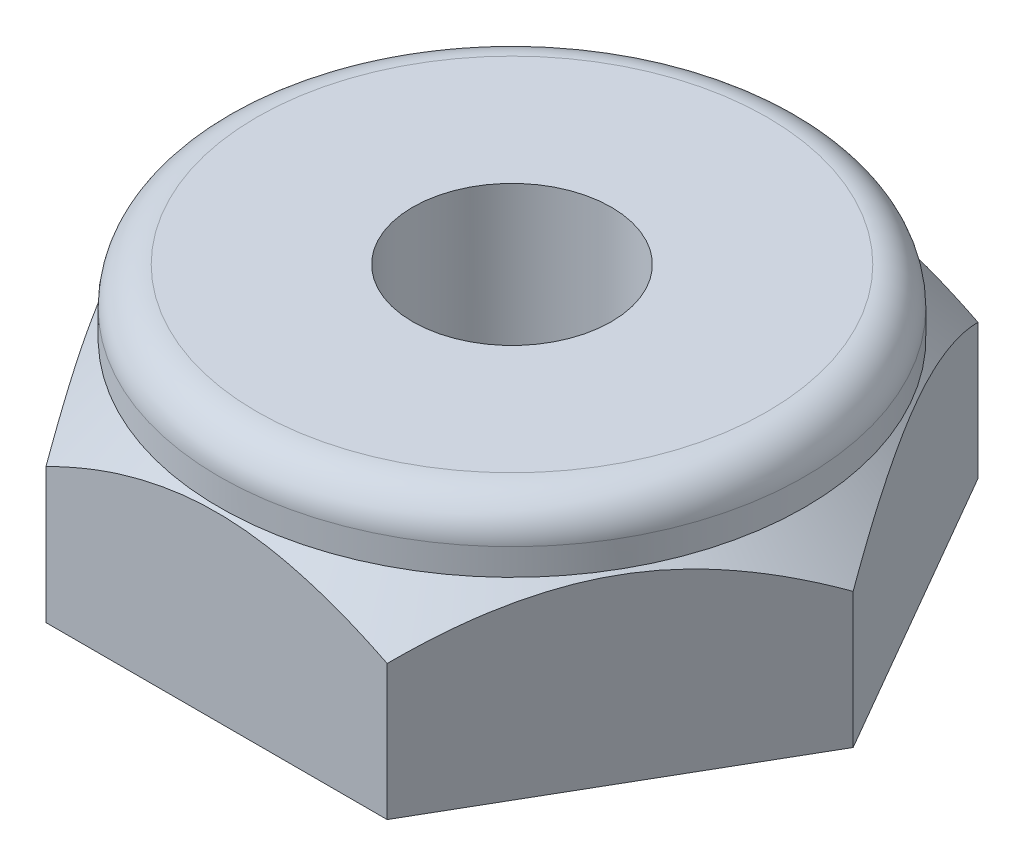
ISO-10303-21;
HEADER;
FILE_DESCRIPTION(('STEP AP214'),'2;1');
FILE_NAME('part.step','',(''),(''),'','','');
FILE_SCHEMA(('AUTOMOTIVE_DESIGN { 1 0 10303 214 1 1 1 1 }'));
ENDSEC;
DATA;
#1=APPLICATION_CONTEXT('core data for automotive mechanical design processes');
#2=APPLICATION_PROTOCOL_DEFINITION('international standard','automotive_design',2000,#1);
#3=PRODUCT_CONTEXT('',#1,'mechanical');
#4=PRODUCT('Part','Part','',(#3));
#5=PRODUCT_RELATED_PRODUCT_CATEGORY('part','',(#4));
#6=PRODUCT_DEFINITION_FORMATION('','',#4);
#7=PRODUCT_DEFINITION_CONTEXT('part definition',#1,'design');
#8=PRODUCT_DEFINITION('design','',#6,#7);
#9=PRODUCT_DEFINITION_SHAPE('','',#8);
#10=(LENGTH_UNIT() NAMED_UNIT(*) SI_UNIT(.MILLI.,.METRE.));
#11=(NAMED_UNIT(*) PLANE_ANGLE_UNIT() SI_UNIT($,.RADIAN.));
#12=(NAMED_UNIT(*) SI_UNIT($,.STERADIAN.) SOLID_ANGLE_UNIT());
#13=UNCERTAINTY_MEASURE_WITH_UNIT(LENGTH_MEASURE(1.E-05),#10,'distance_accuracy_value','');
#14=(GEOMETRIC_REPRESENTATION_CONTEXT(3) GLOBAL_UNCERTAINTY_ASSIGNED_CONTEXT((#13)) GLOBAL_UNIT_ASSIGNED_CONTEXT((#10,
#11,#12)) REPRESENTATION_CONTEXT('',''));
#15=CARTESIAN_POINT('',(0.,0.,0.));
#16=DIRECTION('',(0.,0.,1.));
#17=DIRECTION('',(1.,0.,0.));
#18=AXIS2_PLACEMENT_3D('',#15,#16,#17);
#19=CARTESIAN_POINT('',(-4.54605601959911,-3.302,0.));
#20=DIRECTION('',(-0.866025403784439,0.,0.5));
#21=DIRECTION('',(0.,1.,0.));
#22=AXIS2_PLACEMENT_3D('',#19,#20,#21);
#23=PLANE('',#22);
#24=CARTESIAN_POINT('',(-4.54605601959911,-1.5,0.));
#25=CARTESIAN_POINT('',(-4.49883210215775,-1.45279197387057,0.0817909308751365));
#26=CARTESIAN_POINT('',(-4.4511263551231,-1.40727797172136,0.164324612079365));
#27=CARTESIAN_POINT('',(-4.35662609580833,-1.32209943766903,0.327794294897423));
#28=CARTESIAN_POINT('',(-4.30986746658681,-1.28227694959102,0.408669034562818));
#29=CARTESIAN_POINT('',(-4.21708676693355,-1.20845985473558,0.569265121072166));
#30=CARTESIAN_POINT('',(-4.17109342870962,-1.17431349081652,0.64893268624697));
#31=CARTESIAN_POINT('',(-4.07960762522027,-1.11184717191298,0.807566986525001));
#32=CARTESIAN_POINT('',(-4.03413620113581,-1.08339275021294,0.886492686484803));
#33=CARTESIAN_POINT('',(-3.94336403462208,-1.03228388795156,1.04412591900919));
#34=CARTESIAN_POINT('',(-3.89807712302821,-1.00952755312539,1.12280792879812));
#35=CARTESIAN_POINT('',(-3.83737391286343,-0.982959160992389,1.22816793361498));
#36=CARTESIAN_POINT('',(-3.82225223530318,-0.976661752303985,1.25440530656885));
#37=CARTESIAN_POINT('',(-3.77413176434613,-0.957650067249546,1.33782250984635));
#38=CARTESIAN_POINT('',(-3.74097847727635,-0.946077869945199,1.39518141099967));
#39=CARTESIAN_POINT('',(-3.68311575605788,-0.928697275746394,1.49521841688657));
#40=CARTESIAN_POINT('',(-3.65846760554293,-0.922173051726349,1.53780933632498));
#41=CARTESIAN_POINT('',(-3.60930491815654,-0.910979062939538,1.62277521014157));
#42=CARTESIAN_POINT('',(-3.58479128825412,-0.906292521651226,1.66514845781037));
#43=CARTESIAN_POINT('',(-3.53584321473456,-0.898765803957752,1.74979870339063));
#44=CARTESIAN_POINT('',(-3.51140905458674,-0.895915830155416,1.79207499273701));
#45=CARTESIAN_POINT('',(-3.46255878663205,-0.892060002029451,1.87665195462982));
#46=CARTESIAN_POINT('',(-3.43814269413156,-0.8910518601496,1.9189525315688));
#47=CARTESIAN_POINT('',(-3.38951157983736,-0.890854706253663,2.00320328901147));
#48=CARTESIAN_POINT('',(-3.36529657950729,-0.891650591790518,2.04515344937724));
#49=CARTESIAN_POINT('',(-3.31696230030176,-0.895028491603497,2.12890522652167));
#50=CARTESIAN_POINT('',(-3.29284293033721,-0.897606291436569,2.1707069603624));
#51=CARTESIAN_POINT('',(-3.24465286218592,-0.904545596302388,2.25428475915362));
#52=CARTESIAN_POINT('',(-3.22058231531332,-0.908910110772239,2.29606066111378));
#53=CARTESIAN_POINT('',(-3.17242754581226,-0.919414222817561,2.37969995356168));
#54=CARTESIAN_POINT('',(-3.14834402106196,-0.925563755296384,2.42156249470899));
#55=CARTESIAN_POINT('',(-3.10009377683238,-0.939631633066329,2.50548193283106));
#56=CARTESIAN_POINT('',(-3.07592844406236,-0.947566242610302,2.54753689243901));
#57=CARTESIAN_POINT('',(-3.02743568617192,-0.965197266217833,2.6319398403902));
#58=CARTESIAN_POINT('',(-3.00311029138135,-0.974915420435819,2.67428443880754));
#59=CARTESIAN_POINT('',(-2.95421526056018,-0.996111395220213,2.75935900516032));
#60=CARTESIAN_POINT('',(-2.92964817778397,-1.00761550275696,2.80208387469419));
#61=CARTESIAN_POINT('',(-2.88016701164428,-1.03236763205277,2.88799699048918));
#62=CARTESIAN_POINT('',(-2.85525544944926,-1.04564517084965,2.9311781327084));
#63=CARTESIAN_POINT('',(-2.78424535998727,-1.08571538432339,3.0540705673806));
#64=CARTESIAN_POINT('',(-2.73832755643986,-1.11432093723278,3.13330122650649));
#65=CARTESIAN_POINT('',(-2.64624407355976,-1.17689706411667,3.29216490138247));
#66=CARTESIAN_POINT('',(-2.60009667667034,-1.21097523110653,3.37176579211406));
#67=CARTESIAN_POINT('',(-2.50734219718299,-1.28444565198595,3.53184169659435));
#68=CARTESIAN_POINT('',(-2.46076161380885,-1.32396486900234,3.61227339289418));
#69=CARTESIAN_POINT('',(-2.36694163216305,-1.4083199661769,3.77442193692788));
#70=CARTESIAN_POINT('',(-2.31973518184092,-1.45329247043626,3.85608699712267));
#71=CARTESIAN_POINT('',(-2.27302800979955,-1.5,3.937));
#72=B_SPLINE_CURVE_WITH_KNOTS('',3,(#24,#25,#26,#27,#28,#29,#30,#31,#32,#33,#34,#35,#36,#37,#38,
#39,#40,#41,#42,#43,#44,#45,#46,#47,#48,#49,#50,#51,#52,#53,#54,#55,#56,#57,#58,#59,#60,#61,#62,
#63,#64,#65,#66,#67,#68,#69,#70,#71),.UNSPECIFIED.,.F.,.F.,(4,2,2,2,2,2,2,2,2,2,2,2,2,2,2,2,2,2,
2,2,2,2,2,4),(0.,0.316790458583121,0.62135542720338,0.915599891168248,1.20174788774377,
1.48233951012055,1.57512947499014,1.7768095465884,1.92569920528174,2.073196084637,
2.21989946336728,2.36642051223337,2.51171949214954,2.65667599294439,2.80187766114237,
2.94790350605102,3.09531796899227,3.24466566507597,3.39646704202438,3.55121509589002,
3.83888140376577,4.13311648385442,4.43601850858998,4.74939840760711),.UNSPECIFIED.);
#73=CARTESIAN_POINT('',(-4.54605601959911,-1.5,0.));
#74=VERTEX_POINT('',#73);
#75=CARTESIAN_POINT('',(-2.27302800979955,-1.5,3.937));
#76=VERTEX_POINT('',#75);
#77=EDGE_CURVE('E118',#74,#76,#72,.T.);
#78=ORIENTED_EDGE('',*,*,#77,.F.);
#79=DIRECTION('',(0.,1.,0.));
#80=VECTOR('',#79,1.);
#81=CARTESIAN_POINT('',(-4.54605601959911,-3.302,0.));
#82=LINE('',#81,#80);
#83=CARTESIAN_POINT('',(-4.54605601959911,-3.302,0.));
#84=VERTEX_POINT('',#83);
#85=EDGE_CURVE('E113',#84,#74,#82,.T.);
#86=ORIENTED_EDGE('',*,*,#85,.F.);
#87=DIRECTION('',(0.5,0.,0.866025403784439));
#88=VECTOR('',#87,1.);
#89=CARTESIAN_POINT('',(-4.54605601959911,-3.302,0.));
#90=LINE('',#89,#88);
#91=CARTESIAN_POINT('',(-2.27302800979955,-3.302,3.937));
#92=VERTEX_POINT('',#91);
#93=EDGE_CURVE('E116',#84,#92,#90,.T.);
#94=ORIENTED_EDGE('',*,*,#93,.T.);
#95=DIRECTION('',(0.,1.,0.));
#96=VECTOR('',#95,1.);
#97=CARTESIAN_POINT('',(-2.27302800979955,-3.302,3.937));
#98=LINE('',#97,#96);
#99=EDGE_CURVE('E11',#92,#76,#98,.T.);
#100=ORIENTED_EDGE('',*,*,#99,.T.);
#101=EDGE_LOOP('',(#78,#86,#94,#100));
#102=FACE_BOUND('',#101,.T.);
#103=ADVANCED_FACE('F17',(#102),#23,.T.);
#104=CARTESIAN_POINT('',(-2.27302800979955,-3.302,3.937));
#105=DIRECTION('',(0.,0.,1.));
#106=DIRECTION('',(1.,0.,0.));
#107=AXIS2_PLACEMENT_3D('',#104,#105,#106);
#108=PLANE('',#107);
#109=CARTESIAN_POINT('',(-2.27302800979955,-1.5,3.937));
#110=CARTESIAN_POINT('',(-2.17858302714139,-1.45279197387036,3.93699835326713));
#111=CARTESIAN_POINT('',(-2.08325388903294,-1.40727797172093,3.93695080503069));
#112=CARTESIAN_POINT('',(-1.89443486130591,-1.32209943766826,3.93684602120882));
#113=CARTESIAN_POINT('',(-1.80101596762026,-1.28227694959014,3.93678923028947));
#114=CARTESIAN_POINT('',(-1.61554532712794,-1.20845985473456,3.93673683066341));
#115=CARTESIAN_POINT('',(-1.52355452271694,-1.17431349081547,3.93673921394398));
#116=CARTESIAN_POINT('',(-1.34043028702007,-1.111847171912,3.93682733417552));
#117=CARTESIAN_POINT('',(-1.24934291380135,-1.08339275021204,3.93691077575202));
#118=CARTESIAN_POINT('',(-1.06744244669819,-1.03228388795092,3.93711638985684));
#119=CARTESIAN_POINT('',(-0.976658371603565,-1.00952755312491,3.93723777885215));
#120=CARTESIAN_POINT('',(-0.855062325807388,-0.98295916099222,3.9373472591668));
#121=CARTESIAN_POINT('',(-0.824779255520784,-0.976661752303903,3.93737018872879));
#122=CARTESIAN_POINT('',(-0.72847760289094,-0.957650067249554,3.93740524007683));
#123=CARTESIAN_POINT('',(-0.662226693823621,-0.946077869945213,3.93737310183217));
#124=CARTESIAN_POINT('',(-0.546660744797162,-0.928697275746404,3.93728101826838));
#125=CARTESIAN_POINT('',(-0.497451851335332,-0.922173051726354,3.93723055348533));
#126=CARTESIAN_POINT('',(-0.399287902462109,-0.910979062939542,3.93713735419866));
#127=CARTESIAN_POINT('',(-0.350334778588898,-0.906292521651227,3.93709455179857));
#128=CARTESIAN_POINT('',(-0.252551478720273,-0.898765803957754,3.93702939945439));
#129=CARTESIAN_POINT('',(-0.203722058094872,-0.895915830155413,3.9370069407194));
#130=CARTESIAN_POINT('',(-0.106051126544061,-0.892060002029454,3.93698984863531));
#131=CARTESIAN_POINT('',(-0.0572097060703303,-0.891051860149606,3.93699518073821));
#132=CARTESIAN_POINT('',(0.0400691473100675,-0.890854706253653,3.93700477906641));
#133=CARTESIAN_POINT('',(0.0885065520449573,-0.891650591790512,3.9370090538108));
#134=CARTESIAN_POINT('',(0.185204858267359,-0.895028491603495,3.93702622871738));
#135=CARTESIAN_POINT('',(0.233465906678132,-0.897606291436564,3.93703910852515));
#136=CARTESIAN_POINT('',(0.329941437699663,-0.904545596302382,3.93709418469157));
#137=CARTESIAN_POINT('',(0.378155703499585,-0.908910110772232,3.93713643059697));
#138=CARTESIAN_POINT('',(0.474666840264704,-0.919414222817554,3.93725282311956));
#139=CARTESIAN_POINT('',(0.522962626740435,-0.925563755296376,3.93732714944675));
#140=CARTESIAN_POINT('',(0.619764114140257,-0.939631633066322,3.93750093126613));
#141=CARTESIAN_POINT('',(0.668267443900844,-0.947566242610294,3.93760061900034));
#142=CARTESIAN_POINT('',(0.765608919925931,-0.965197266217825,3.93780613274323));
#143=CARTESIAN_POINT('',(0.814443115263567,-0.974915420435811,3.93791202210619));
#144=CARTESIAN_POINT('',(0.912567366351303,-0.996111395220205,3.93810496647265));
#145=CARTESIAN_POINT('',(0.961851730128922,-1.00761550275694,3.93819168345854));
#146=CARTESIAN_POINT('',(1.06099525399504,-1.03236763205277,3.9382962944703));
#147=CARTESIAN_POINT('',(1.11084700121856,-1.04564517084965,3.93831281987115));
#148=CARTESIAN_POINT('',(1.25278001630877,-1.08571538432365,3.93826249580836));
#149=CARTESIAN_POINT('',(1.34435468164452,-1.11432093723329,3.93811184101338));
#150=CARTESIAN_POINT('',(1.52797640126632,-1.17689706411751,3.93779704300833));
#151=CARTESIAN_POINT('',(1.61998649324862,-1.21097523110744,3.93763267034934));
#152=CARTESIAN_POINT('',(1.80499353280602,-1.28444565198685,3.93734288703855));
#153=CARTESIAN_POINT('',(1.89793971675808,-1.32396486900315,3.9372187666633));
#154=CARTESIAN_POINT('',(2.08527446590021,-1.40831996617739,3.93704255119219));
#155=CARTESIAN_POINT('',(2.17960170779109,-1.45329247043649,3.93699309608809));
#156=CARTESIAN_POINT('',(2.27302800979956,-1.5,3.937));
#157=B_SPLINE_CURVE_WITH_KNOTS('',3,(#109,#110,#111,#112,#113,#114,#115,#116,#117,#118,#119,
#120,#121,#122,#123,#124,#125,#126,#127,#128,#129,#130,#131,#132,#133,#134,#135,#136,#137,#138,
#139,#140,#141,#142,#143,#144,#145,#146,#147,#148,#149,#150,#151,#152,#153,#154,#155,#156),
.UNSPECIFIED.,.F.,.F.,(4,2,2,2,2,2,2,2,2,2,2,2,2,2,2,2,2,2,2,2,2,2,2,4),(0.,0.316790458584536,
0.621355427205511,0.915599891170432,1.2017478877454,1.4823395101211,1.57512947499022,
1.77680954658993,1.92569920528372,2.07319608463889,2.21989946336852,2.3664205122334,
2.51171949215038,2.6566759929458,2.80187766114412,2.94790350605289,3.09531796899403,
3.24466566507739,3.39646704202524,3.5512150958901,3.83888140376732,4.13311648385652,
4.4360185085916,4.74939840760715),.UNSPECIFIED.);
#158=CARTESIAN_POINT('',(2.27302800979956,-1.5,3.937));
#159=VERTEX_POINT('',#158);
#160=EDGE_CURVE('E216',#76,#159,#157,.T.);
#161=ORIENTED_EDGE('',*,*,#160,.F.);
#162=ORIENTED_EDGE('',*,*,#99,.F.);
#163=DIRECTION('',(1.,0.,0.));
#164=VECTOR('',#163,1.);
#165=CARTESIAN_POINT('',(-2.27302800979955,-3.302,3.937));
#166=LINE('',#165,#164);
#167=CARTESIAN_POINT('',(2.27302800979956,-3.302,3.937));
#168=VERTEX_POINT('',#167);
#169=EDGE_CURVE('E138',#92,#168,#166,.T.);
#170=ORIENTED_EDGE('',*,*,#169,.T.);
#171=DIRECTION('',(0.,1.,0.));
#172=VECTOR('',#171,1.);
#173=CARTESIAN_POINT('',(2.27302800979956,-3.302,3.937));
#174=LINE('',#173,#172);
#175=EDGE_CURVE('E30',#168,#159,#174,.T.);
#176=ORIENTED_EDGE('',*,*,#175,.T.);
#177=EDGE_LOOP('',(#161,#162,#170,#176));
#178=FACE_BOUND('',#177,.T.);
#179=ADVANCED_FACE('F19',(#178),#108,.T.);
#180=CARTESIAN_POINT('',(2.27302800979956,-3.302,3.937));
#181=DIRECTION('',(0.866025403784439,0.,0.5));
#182=DIRECTION('',(0.,-1.,0.));
#183=AXIS2_PLACEMENT_3D('',#180,#181,#182);
#184=PLANE('',#183);
#185=CARTESIAN_POINT('',(2.27302800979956,-1.5,3.937));
#186=CARTESIAN_POINT('',(2.32024907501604,-1.45279197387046,3.85520742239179));
#187=CARTESIAN_POINT('',(2.36787246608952,-1.40727797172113,3.77262619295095));
#188=CARTESIAN_POINT('',(2.46219123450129,-1.32209943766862,3.6090517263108));
#189=CARTESIAN_POINT('',(2.50885149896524,-1.28227694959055,3.52812019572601));
#190=CARTESIAN_POINT('',(2.60154143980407,-1.20845985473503,3.36747170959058));
#191=CARTESIAN_POINT('',(2.64753890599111,-1.17431349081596,3.28780652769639));
#192=CARTESIAN_POINT('',(2.73917733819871,-1.11184717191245,3.12926034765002));
#193=CARTESIAN_POINT('',(2.78479328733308,-1.08339275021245,3.0504180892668));
#194=CARTESIAN_POINT('',(2.8759215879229,-1.03228388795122,2.89299047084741));
#195=CARTESIAN_POINT('',(2.92141875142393,-1.00952755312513,2.8144298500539));
#196=CARTESIAN_POINT('',(2.98231158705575,-0.9829591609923,2.70917932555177));
#197=CARTESIAN_POINT('',(2.99747297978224,-0.976661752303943,2.68296488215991));
#198=CARTESIAN_POINT('',(3.04565416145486,-0.957650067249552,2.59958273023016));
#199=CARTESIAN_POINT('',(3.07875178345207,-0.946077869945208,2.5421916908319));
#200=CARTESIAN_POINT('',(3.13645501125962,-0.9286972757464,2.44206260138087));
#201=CARTESIAN_POINT('',(3.16101575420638,-0.922173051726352,2.39942121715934));
#202=CARTESIAN_POINT('',(3.21001701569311,-0.91097906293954,2.31436214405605));
#203=CARTESIAN_POINT('',(3.23445650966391,-0.906292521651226,2.27194609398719));
#204=CARTESIAN_POINT('',(3.28329173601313,-0.898765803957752,2.18723069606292));
#205=CARTESIAN_POINT('',(3.30768699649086,-0.895915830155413,2.14493194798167));
#206=CARTESIAN_POINT('',(3.3565076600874,-0.892060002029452,2.0603378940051));
#207=CARTESIAN_POINT('',(3.38093298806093,-0.891051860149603,2.01804264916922));
#208=CARTESIAN_POINT('',(3.42958072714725,-0.890854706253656,1.93380149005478));
#209=CARTESIAN_POINT('',(3.4538031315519,-0.891650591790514,1.89185560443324));
#210=CARTESIAN_POINT('',(3.50216715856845,-0.895028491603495,1.80812100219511));
#211=CARTESIAN_POINT('',(3.52630883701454,-0.897606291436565,1.76633214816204));
#212=CARTESIAN_POINT('',(3.57459429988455,-0.904545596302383,1.68280942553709));
#213=CARTESIAN_POINT('',(3.59873801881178,-0.908910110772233,1.64107576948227));
#214=CARTESIAN_POINT('',(3.6470943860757,-0.919414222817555,1.5575528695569));
#215=CARTESIAN_POINT('',(3.67130664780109,-0.925563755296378,1.51576465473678));
#216=CARTESIAN_POINT('',(3.71985789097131,-0.939631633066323,1.43201899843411));
#217=CARTESIAN_POINT('',(3.74419588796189,-0.947566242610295,1.39006372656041));
#218=CARTESIAN_POINT('',(3.79304460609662,-0.965197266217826,1.30586629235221));
#219=CARTESIAN_POINT('',(3.81755340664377,-0.974915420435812,1.2636275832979));
#220=CARTESIAN_POINT('',(3.86678262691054,-0.996111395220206,1.17874596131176));
#221=CARTESIAN_POINT('',(3.89149990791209,-1.00761550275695,1.13610780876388));
#222=CARTESIAN_POINT('',(3.94116226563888,-1.03236763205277,1.05029930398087));
#223=CARTESIAN_POINT('',(3.9661024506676,-1.04564517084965,1.00713468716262));
#224=CARTESIAN_POINT('',(4.03702537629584,-1.08571538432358,0.884191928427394));
#225=CARTESIAN_POINT('',(4.08268223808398,-1.11432093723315,0.804810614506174));
#226=CARTESIAN_POINT('',(4.17422047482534,-1.17689706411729,0.645632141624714));
#227=CARTESIAN_POINT('',(4.2200831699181,-1.21097523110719,0.565866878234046));
#228=CARTESIAN_POINT('',(4.31233572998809,-1.28444565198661,0.405501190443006));
#229=CARTESIAN_POINT('',(4.35870133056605,-1.32396486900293,0.32494537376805));
#230=CARTESIAN_POINT('',(4.45221609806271,-1.40831996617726,0.162620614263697));
#231=CARTESIAN_POINT('',(4.49933688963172,-1.45329247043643,0.0809060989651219));
#232=CARTESIAN_POINT('',(4.54605601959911,-1.5,0.));
#233=B_SPLINE_CURVE_WITH_KNOTS('',3,(#185,#186,#187,#188,#189,#190,#191,#192,#193,#194,#195,
#196,#197,#198,#199,#200,#201,#202,#203,#204,#205,#206,#207,#208,#209,#210,#211,#212,#213,#214,
#215,#216,#217,#218,#219,#220,#221,#222,#223,#224,#225,#226,#227,#228,#229,#230,#231,#232),
.UNSPECIFIED.,.F.,.F.,(4,2,2,2,2,2,2,2,2,2,2,2,2,2,2,2,2,2,2,2,2,2,2,4),(0.,0.316790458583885,
0.621355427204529,0.915599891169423,1.20174788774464,1.48233951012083,1.57512947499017,
1.77680954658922,1.9256992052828,2.07319608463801,2.21989946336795,2.36642051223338,
2.51171949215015,2.65667599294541,2.80187766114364,2.94790350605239,3.09531796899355,
3.244665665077,3.396467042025,3.55121509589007,3.8388814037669,4.13311648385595,
4.43601850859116,4.74939840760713),.UNSPECIFIED.);
#234=CARTESIAN_POINT('',(4.54605601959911,-1.5,0.));
#235=VERTEX_POINT('',#234);
#236=EDGE_CURVE('E241',#159,#235,#233,.T.);
#237=ORIENTED_EDGE('',*,*,#236,.F.);
#238=ORIENTED_EDGE('',*,*,#175,.F.);
#239=DIRECTION('',(0.5,0.,-0.866025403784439));
#240=VECTOR('',#239,1.);
#241=CARTESIAN_POINT('',(2.27302800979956,-3.302,3.937));
#242=LINE('',#241,#240);
#243=CARTESIAN_POINT('',(4.54605601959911,-3.302,0.));
#244=VERTEX_POINT('',#243);
#245=EDGE_CURVE('E153',#168,#244,#242,.T.);
#246=ORIENTED_EDGE('',*,*,#245,.T.);
#247=DIRECTION('',(0.,1.,0.));
#248=VECTOR('',#247,1.);
#249=CARTESIAN_POINT('',(4.54605601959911,-3.302,0.));
#250=LINE('',#249,#248);
#251=EDGE_CURVE('E55',#244,#235,#250,.T.);
#252=ORIENTED_EDGE('',*,*,#251,.T.);
#253=EDGE_LOOP('',(#237,#238,#246,#252));
#254=FACE_BOUND('',#253,.T.);
#255=ADVANCED_FACE('F279',(#254),#184,.T.);
#256=CARTESIAN_POINT('',(4.54605601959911,-3.302,0.));
#257=DIRECTION('',(0.866025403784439,0.,-0.5));
#258=DIRECTION('',(0.,-1.,0.));
#259=AXIS2_PLACEMENT_3D('',#256,#257,#258);
#260=PLANE('',#259);
#261=CARTESIAN_POINT('',(4.54605601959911,-1.5,0.));
#262=CARTESIAN_POINT('',(4.498832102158,-1.45279197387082,-0.0817909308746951));
#263=CARTESIAN_POINT('',(4.45112635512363,-1.40727797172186,-0.164324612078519));
#264=CARTESIAN_POINT('',(4.35662609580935,-1.32209943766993,-0.327794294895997));
#265=CARTESIAN_POINT('',(4.30986746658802,-1.28227694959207,-0.408669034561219));
#266=CARTESIAN_POINT('',(4.21708676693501,-1.20845985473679,-0.569265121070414));
#267=CARTESIAN_POINT('',(4.17109342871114,-1.17431349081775,-0.648932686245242));
#268=CARTESIAN_POINT('',(4.07960762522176,-1.11184717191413,-0.80756698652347));
#269=CARTESIAN_POINT('',(4.0341362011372,-1.083392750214,-0.88649268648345));
#270=CARTESIAN_POINT('',(3.9433640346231,-1.03228388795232,-1.04412591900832));
#271=CARTESIAN_POINT('',(3.89807712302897,-1.00952755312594,-1.12280792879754));
#272=CARTESIAN_POINT('',(3.8373739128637,-0.982959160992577,-1.22816793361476));
#273=CARTESIAN_POINT('',(3.82225223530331,-0.976661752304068,-1.25440530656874));
#274=CARTESIAN_POINT('',(3.77413176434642,-0.957650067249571,-1.33782250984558));
#275=CARTESIAN_POINT('',(3.74097847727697,-0.946077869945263,-1.39518141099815));
#276=CARTESIAN_POINT('',(3.68311575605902,-0.92869727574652,-1.49521841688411));
#277=CARTESIAN_POINT('',(3.65846760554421,-0.922173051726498,-1.53780933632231));
#278=CARTESIAN_POINT('',(3.60930491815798,-0.910979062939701,-1.62277521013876));
#279=CARTESIAN_POINT('',(3.58479128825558,-0.90629252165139,-1.66514845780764));
#280=CARTESIAN_POINT('',(3.53584321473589,-0.898765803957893,-1.74979870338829));
#281=CARTESIAN_POINT('',(3.51140905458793,-0.895915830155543,-1.792074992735));
#282=CARTESIAN_POINT('',(3.46255878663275,-0.892060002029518,-1.8766519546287));
#283=CARTESIAN_POINT('',(3.43814269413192,-0.891051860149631,-1.91895253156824));
#284=CARTESIAN_POINT('',(3.38951157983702,-0.890854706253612,-2.00320328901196));
#285=CARTESIAN_POINT('',(3.36529657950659,-0.89165059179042,-2.04515344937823));
#286=CARTESIAN_POINT('',(3.3169623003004,-0.895028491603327,-2.12890522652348));
#287=CARTESIAN_POINT('',(3.29284293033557,-0.897606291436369,-2.17070696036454));
#288=CARTESIAN_POINT('',(3.24465286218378,-0.904545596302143,-2.25428475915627));
#289=CARTESIAN_POINT('',(3.22058231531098,-0.908910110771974,-2.29606066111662));
#290=CARTESIAN_POINT('',(3.17242754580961,-0.919414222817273,-2.37969995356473));
#291=CARTESIAN_POINT('',(3.14834402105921,-0.925563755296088,-2.42156249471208));
#292=CARTESIAN_POINT('',(3.10009377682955,-0.939631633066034,-2.5054819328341));
#293=CARTESIAN_POINT('',(3.07592844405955,-0.94756624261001,-2.54753689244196));
#294=CARTESIAN_POINT('',(3.02743568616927,-0.965197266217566,-2.63193984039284));
#295=CARTESIAN_POINT('',(3.00311029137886,-0.974915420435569,-2.67428443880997));
#296=CARTESIAN_POINT('',(2.95421526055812,-0.996111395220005,-2.75935900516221));
#297=CARTESIAN_POINT('',(2.9296481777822,-1.00761550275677,-2.80208387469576));
#298=CARTESIAN_POINT('',(2.8801670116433,-1.03236763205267,-2.88799699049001));
#299=CARTESIAN_POINT('',(2.85525544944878,-1.04564517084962,-2.93117813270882));
#300=CARTESIAN_POINT('',(2.78424535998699,-1.08571538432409,-3.05407056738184));
#301=CARTESIAN_POINT('',(2.73832755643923,-1.11432093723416,-3.13330122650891));
#302=CARTESIAN_POINT('',(2.6462440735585,-1.17689706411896,-3.29216490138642));
#303=CARTESIAN_POINT('',(2.60009667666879,-1.21097523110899,-3.37176579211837));
#304=CARTESIAN_POINT('',(2.5073421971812,-1.2844456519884,-3.53184169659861));
#305=CARTESIAN_POINT('',(2.4607616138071,-1.32396486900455,-3.61227339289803));
#306=CARTESIAN_POINT('',(2.36694163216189,-1.40831996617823,-3.77442193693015));
#307=CARTESIAN_POINT('',(2.31973518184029,-1.4532924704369,-3.85608699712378));
#308=CARTESIAN_POINT('',(2.27302800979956,-1.5,-3.937));
#309=B_SPLINE_CURVE_WITH_KNOTS('',3,(#261,#262,#263,#264,#265,#266,#267,#268,#269,#270,#271,
#272,#273,#274,#275,#276,#277,#278,#279,#280,#281,#282,#283,#284,#285,#286,#287,#288,#289,#290,
#291,#292,#293,#294,#295,#296,#297,#298,#299,#300,#301,#302,#303,#304,#305,#306,#307,#308),
.UNSPECIFIED.,.F.,.F.,(4,2,2,2,2,2,2,2,2,2,2,2,2,2,2,2,2,2,2,2,2,2,2,4),(0.,0.316790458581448,
0.621355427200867,0.915599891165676,1.20174788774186,1.48233951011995,1.57512947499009,
1.77680954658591,1.92569920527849,2.0731960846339,2.21989946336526,2.36642051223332,
2.51171949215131,2.65667599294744,2.80187766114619,2.94790350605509,3.09531796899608,
3.24466566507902,3.3964670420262,3.55121509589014,3.83888140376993,4.13311648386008,
4.43601850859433,4.74939840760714),.UNSPECIFIED.);
#310=CARTESIAN_POINT('',(2.27302800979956,-1.5,-3.937));
#311=VERTEX_POINT('',#310);
#312=EDGE_CURVE('E378',#235,#311,#309,.T.);
#313=ORIENTED_EDGE('',*,*,#312,.F.);
#314=ORIENTED_EDGE('',*,*,#251,.F.);
#315=DIRECTION('',(-0.5,0.,-0.866025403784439));
#316=VECTOR('',#315,1.);
#317=CARTESIAN_POINT('',(4.54605601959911,-3.302,0.));
#318=LINE('',#317,#316);
#319=CARTESIAN_POINT('',(2.27302800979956,-3.302,-3.937));
#320=VERTEX_POINT('',#319);
#321=EDGE_CURVE('E150',#244,#320,#318,.T.);
#322=ORIENTED_EDGE('',*,*,#321,.T.);
#323=DIRECTION('',(0.,1.,0.));
#324=VECTOR('',#323,1.);
#325=CARTESIAN_POINT('',(2.27302800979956,-3.302,-3.937));
#326=LINE('',#325,#324);
#327=EDGE_CURVE('E123',#320,#311,#326,.T.);
#328=ORIENTED_EDGE('',*,*,#327,.T.);
#329=EDGE_LOOP('',(#313,#314,#322,#328));
#330=FACE_BOUND('',#329,.T.);
#331=ADVANCED_FACE('F176',(#330),#260,.T.);
#332=CARTESIAN_POINT('',(2.27302800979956,-3.302,-3.937));
#333=DIRECTION('',(0.,0.,-1.));
#334=DIRECTION('',(0.,-1.,0.));
#335=AXIS2_PLACEMENT_3D('',#332,#333,#334);
#336=PLANE('',#335);
#337=CARTESIAN_POINT('',(2.27302800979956,-1.5,-3.937));
#338=CARTESIAN_POINT('',(2.17858302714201,-1.45279197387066,-3.93699835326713));
#339=CARTESIAN_POINT('',(2.08325388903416,-1.40727797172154,-3.93695080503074));
#340=CARTESIAN_POINT('',(1.89443486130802,-1.32209943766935,-3.936846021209));
#341=CARTESIAN_POINT('',(1.80101596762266,-1.2822769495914,-3.93678923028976));
#342=CARTESIAN_POINT('',(1.61554532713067,-1.20845985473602,-3.93673683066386));
#343=CARTESIAN_POINT('',(1.52355452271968,-1.17431349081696,-3.93673921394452));
#344=CARTESIAN_POINT('',(1.34043028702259,-1.1118471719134,-3.93682733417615));
#345=CARTESIAN_POINT('',(1.24934291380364,-1.08339275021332,-3.93691077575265));
#346=CARTESIAN_POINT('',(1.06744244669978,-1.03228388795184,-3.93711638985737));
#347=CARTESIAN_POINT('',(0.976658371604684,-1.00952755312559,-3.93723777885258));
#348=CARTESIAN_POINT('',(0.855062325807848,-0.98295916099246,-3.93734725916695));
#349=CARTESIAN_POINT('',(0.824779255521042,-0.976661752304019,-3.93737018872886));
#350=CARTESIAN_POINT('',(0.7284776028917,-0.957650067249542,-3.93740524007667));
#351=CARTESIAN_POINT('',(0.662226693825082,-0.946077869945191,-3.9373731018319));
#352=CARTESIAN_POINT('',(0.546660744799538,-0.928697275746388,-3.93728101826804));
#353=CARTESIAN_POINT('',(0.497451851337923,-0.922173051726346,-3.93723055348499));
#354=CARTESIAN_POINT('',(0.399287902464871,-0.910979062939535,-3.93713735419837));
#355=CARTESIAN_POINT('',(0.350334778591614,-0.906292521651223,-3.93709455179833));
#356=CARTESIAN_POINT('',(0.252551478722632,-0.898765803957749,-3.93702939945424));
#357=CARTESIAN_POINT('',(0.20372205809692,-0.895915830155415,-3.9370069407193));
#358=CARTESIAN_POINT('',(0.106051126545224,-0.892060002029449,-3.93698984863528));
#359=CARTESIAN_POINT('',(0.0572097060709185,-0.891051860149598,-3.9369951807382));
#360=CARTESIAN_POINT('',(-0.0400691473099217,-0.890854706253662,-3.93700477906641));
#361=CARTESIAN_POINT('',(-0.0885065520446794,-0.891650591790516,-3.93700905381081));
#362=CARTESIAN_POINT('',(-0.185204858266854,-0.895028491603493,-3.9370262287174));
#363=CARTESIAN_POINT('',(-0.233465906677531,-0.897606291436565,-3.93703910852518));
#364=CARTESIAN_POINT('',(-0.329941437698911,-0.904545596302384,-3.93709418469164));
#365=CARTESIAN_POINT('',(-0.378155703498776,-0.908910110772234,-3.93713643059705));
#366=CARTESIAN_POINT('',(-0.47466684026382,-0.919414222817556,-3.93725282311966));
#367=CARTESIAN_POINT('',(-0.522962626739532,-0.925563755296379,-3.93732714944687));
#368=CARTESIAN_POINT('',(-0.619764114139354,-0.939631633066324,-3.93750093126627));
#369=CARTESIAN_POINT('',(-0.66826744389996,-0.947566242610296,-3.9376006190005));
#370=CARTESIAN_POINT('',(-0.765608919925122,-0.965197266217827,-3.93780613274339));
#371=CARTESIAN_POINT('',(-0.814443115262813,-0.974915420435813,-3.93791202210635));
#372=CARTESIAN_POINT('',(-0.9125673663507,-0.996111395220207,-3.93810496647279));
#373=CARTESIAN_POINT('',(-0.961851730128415,-1.00761550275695,-3.93819168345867));
#374=CARTESIAN_POINT('',(-1.06099525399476,-1.03236763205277,-3.93829629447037));
#375=CARTESIAN_POINT('',(-1.11084700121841,-1.04564517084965,-3.93831281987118));
#376=CARTESIAN_POINT('',(-1.25278001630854,-1.08571538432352,-3.9382624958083));
#377=CARTESIAN_POINT('',(-1.34435468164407,-1.11432093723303,-3.93811184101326));
#378=CARTESIAN_POINT('',(-1.52797640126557,-1.17689706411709,-3.93779704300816));
#379=CARTESIAN_POINT('',(-1.61998649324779,-1.21097523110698,-3.93763267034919));
#380=CARTESIAN_POINT('',(-1.80499353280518,-1.2844456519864,-3.93734288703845));
#381=CARTESIAN_POINT('',(-1.89793971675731,-1.32396486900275,-3.93721876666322));
#382=CARTESIAN_POINT('',(-2.08527446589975,-1.40831996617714,-3.93704255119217));
#383=CARTESIAN_POINT('',(-2.17960170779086,-1.45329247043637,-3.93699309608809));
#384=CARTESIAN_POINT('',(-2.27302800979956,-1.5,-3.93699999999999));
#385=B_SPLINE_CURVE_WITH_KNOTS('',3,(#337,#338,#339,#340,#341,#342,#343,#344,#345,#346,#347,
#348,#349,#350,#351,#352,#353,#354,#355,#356,#357,#358,#359,#360,#361,#362,#363,#364,#365,#366,
#367,#368,#369,#370,#371,#372,#373,#374,#375,#376,#377,#378,#379,#380,#381,#382,#383,#384),
.UNSPECIFIED.,.F.,.F.,(4,2,2,2,2,2,2,2,2,2,2,2,2,2,2,2,2,2,2,2,2,2,2,4),(0.,0.316790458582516,
0.621355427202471,0.915599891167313,1.20174788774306,1.48233951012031,1.5751294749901,
1.77680954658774,1.92569920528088,2.07319608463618,2.21989946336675,2.36642051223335,
2.51171949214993,2.65667599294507,2.80187766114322,2.94790350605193,3.09531796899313,
3.24466566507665,3.39646704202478,3.55121509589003,3.83888140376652,4.13311648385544,
4.43601850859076,4.7493984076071),.UNSPECIFIED.);
#386=CARTESIAN_POINT('',(-2.27302800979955,-1.5,-3.937));
#387=VERTEX_POINT('',#386);
#388=EDGE_CURVE('E379',#311,#387,#385,.T.);
#389=ORIENTED_EDGE('',*,*,#388,.F.);
#390=ORIENTED_EDGE('',*,*,#327,.F.);
#391=DIRECTION('',(-1.,0.,0.));
#392=VECTOR('',#391,1.);
#393=CARTESIAN_POINT('',(2.27302800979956,-3.302,-3.937));
#394=LINE('',#393,#392);
#395=CARTESIAN_POINT('',(-2.27302800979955,-3.302,-3.937));
#396=VERTEX_POINT('',#395);
#397=EDGE_CURVE('E133',#320,#396,#394,.T.);
#398=ORIENTED_EDGE('',*,*,#397,.T.);
#399=DIRECTION('',(0.,1.,0.));
#400=VECTOR('',#399,1.);
#401=CARTESIAN_POINT('',(-2.27302800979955,-3.302,-3.937));
#402=LINE('',#401,#400);
#403=EDGE_CURVE('E124',#396,#387,#402,.T.);
#404=ORIENTED_EDGE('',*,*,#403,.T.);
#405=EDGE_LOOP('',(#389,#390,#398,#404));
#406=FACE_BOUND('',#405,.T.);
#407=ADVANCED_FACE('F342',(#406),#336,.T.);
#408=CARTESIAN_POINT('',(-2.27302800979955,-3.302,-3.937));
#409=DIRECTION('',(-0.866025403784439,0.,-0.5));
#410=DIRECTION('',(-0.5,0.,0.866025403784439));
#411=AXIS2_PLACEMENT_3D('',#408,#409,#410);
#412=PLANE('',#411);
#413=CARTESIAN_POINT('',(-2.27302800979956,-1.5,-3.937));
#414=CARTESIAN_POINT('',(-2.32024907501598,-1.45279197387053,-3.8552074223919));
#415=CARTESIAN_POINT('',(-2.3678724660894,-1.40727797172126,-3.77262619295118));
#416=CARTESIAN_POINT('',(-2.46219123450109,-1.32209943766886,-3.60905172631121));
#417=CARTESIAN_POINT('',(-2.50885149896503,-1.28227694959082,-3.52812019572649));
#418=CARTESIAN_POINT('',(-2.60154143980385,-1.20845985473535,-3.36747170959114));
#419=CARTESIAN_POINT('',(-2.64753890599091,-1.17431349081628,-3.28780652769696));
#420=CARTESIAN_POINT('',(-2.73917733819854,-1.11184717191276,-3.12926034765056));
#421=CARTESIAN_POINT('',(-2.78479328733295,-1.08339275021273,-3.05041808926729));
#422=CARTESIAN_POINT('',(-2.87592158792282,-1.03228388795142,-2.89299047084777));
#423=CARTESIAN_POINT('',(-2.92141875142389,-1.00952755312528,-2.81442985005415));
#424=CARTESIAN_POINT('',(-2.98231158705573,-0.982959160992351,-2.70917932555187));
#425=CARTESIAN_POINT('',(-2.99747297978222,-0.976661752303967,-2.68296488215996));
#426=CARTESIAN_POINT('',(-3.04565416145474,-0.957650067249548,-2.59958273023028));
#427=CARTESIAN_POINT('',(-3.07875178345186,-0.946077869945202,-2.54219169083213));
#428=CARTESIAN_POINT('',(-3.1364550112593,-0.928697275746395,-2.44206260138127));
#429=CARTESIAN_POINT('',(-3.16101575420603,-0.922173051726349,-2.39942121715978));
#430=CARTESIAN_POINT('',(-3.21001701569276,-0.910979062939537,-2.31436214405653));
#431=CARTESIAN_POINT('',(-3.23445650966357,-0.906292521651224,-2.27194609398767));
#432=CARTESIAN_POINT('',(-3.28329173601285,-0.89876580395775,-2.18723069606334));
#433=CARTESIAN_POINT('',(-3.30768699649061,-0.895915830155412,-2.14493194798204));
#434=CARTESIAN_POINT('',(-3.35650766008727,-0.892060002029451,-2.06033789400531));
#435=CARTESIAN_POINT('',(-3.38093298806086,-0.891051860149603,-2.01804264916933));
#436=CARTESIAN_POINT('',(-3.42958072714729,-0.890854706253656,-1.93380149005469));
#437=CARTESIAN_POINT('',(-3.45380313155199,-0.891650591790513,-1.89185560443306));
#438=CARTESIAN_POINT('',(-3.50216715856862,-0.895028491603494,-1.80812100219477));
#439=CARTESIAN_POINT('',(-3.52630883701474,-0.897606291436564,-1.76633214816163));
#440=CARTESIAN_POINT('',(-3.57459429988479,-0.904545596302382,-1.68280942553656));
#441=CARTESIAN_POINT('',(-3.59873801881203,-0.908910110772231,-1.6410757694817));
#442=CARTESIAN_POINT('',(-3.64709438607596,-0.919414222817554,-1.55755286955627));
#443=CARTESIAN_POINT('',(-3.67130664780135,-0.925563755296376,-1.51576465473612));
#444=CARTESIAN_POINT('',(-3.71985789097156,-0.939631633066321,-1.43201899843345));
#445=CARTESIAN_POINT('',(-3.74419588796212,-0.947566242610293,-1.39006372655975));
#446=CARTESIAN_POINT('',(-3.79304460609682,-0.965197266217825,-1.30586629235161));
#447=CARTESIAN_POINT('',(-3.81755340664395,-0.974915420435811,-1.26362758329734));
#448=CARTESIAN_POINT('',(-3.86678262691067,-0.996111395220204,-1.1787459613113));
#449=CARTESIAN_POINT('',(-3.89149990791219,-1.00761550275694,-1.13610780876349));
#450=CARTESIAN_POINT('',(-3.94116226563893,-1.03236763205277,-1.05029930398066));
#451=CARTESIAN_POINT('',(-3.96610245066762,-1.04564517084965,-1.00713468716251));
#452=CARTESIAN_POINT('',(-4.03702537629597,-1.08571538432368,-0.884191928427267));
#453=CARTESIAN_POINT('',(-4.08268223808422,-1.11432093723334,-0.804810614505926));
#454=CARTESIAN_POINT('',(-4.17422047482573,-1.17689706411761,-0.645632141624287));
#455=CARTESIAN_POINT('',(-4.22008316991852,-1.21097523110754,-0.565866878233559));
#456=CARTESIAN_POINT('',(-4.31233572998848,-1.28444565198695,-0.405501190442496));
#457=CARTESIAN_POINT('',(-4.35870133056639,-1.32396486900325,-0.324945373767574));
#458=CARTESIAN_POINT('',(-4.4522160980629,-1.40831996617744,-0.162620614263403));
#459=CARTESIAN_POINT('',(-4.49933688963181,-1.45329247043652,-0.0809060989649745));
#460=CARTESIAN_POINT('',(-4.54605601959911,-1.5,0.));
#461=B_SPLINE_CURVE_WITH_KNOTS('',3,(#413,#414,#415,#416,#417,#418,#419,#420,#421,#422,#423,
#424,#425,#426,#427,#428,#429,#430,#431,#432,#433,#434,#435,#436,#437,#438,#439,#440,#441,#442,
#443,#444,#445,#446,#447,#448,#449,#450,#451,#452,#453,#454,#455,#456,#457,#458,#459,#460),
.UNSPECIFIED.,.F.,.F.,(4,2,2,2,2,2,2,2,2,2,2,2,2,2,2,2,2,2,2,2,2,2,2,4),(0.,0.316790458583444,
0.621355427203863,0.91559989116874,1.20174788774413,1.48233951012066,1.57512947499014,
1.77680954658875,1.92569920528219,2.07319608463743,2.21989946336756,2.36642051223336,
2.51171949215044,2.65667599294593,2.8018776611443,2.94790350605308,3.09531796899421,
3.24466566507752,3.39646704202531,3.55121509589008,3.83888140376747,4.13311648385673,
4.43601850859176,4.74939840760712),.UNSPECIFIED.);
#462=EDGE_CURVE('E157',#387,#74,#461,.T.);
#463=ORIENTED_EDGE('',*,*,#462,.F.);
#464=ORIENTED_EDGE('',*,*,#403,.F.);
#465=DIRECTION('',(-0.5,0.,0.866025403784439));
#466=VECTOR('',#465,1.);
#467=CARTESIAN_POINT('',(-2.27302800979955,-3.302,-3.937));
#468=LINE('',#467,#466);
#469=EDGE_CURVE('E127',#396,#84,#468,.T.);
#470=ORIENTED_EDGE('',*,*,#469,.T.);
#471=ORIENTED_EDGE('',*,*,#85,.T.);
#472=EDGE_LOOP('',(#463,#464,#470,#471));
#473=FACE_BOUND('',#472,.T.);
#474=ADVANCED_FACE('F128',(#473),#412,.T.);
#475=CARTESIAN_POINT('',(-2.27302800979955,-3.302,3.937));
#476=DIRECTION('',(0.,1.,0.));
#477=DIRECTION('',(1.,0.,0.));
#478=AXIS2_PLACEMENT_3D('',#475,#476,#477);
#479=PLANE('',#478);
#480=CARTESIAN_POINT('',(0.,-3.302,0.));
#481=DIRECTION('',(0.,1.,0.));
#482=DIRECTION('',(0.,0.,-1.));
#483=AXIS2_PLACEMENT_3D('',#480,#481,#482);
#484=CIRCLE('',#483,1.32334);
#485=CARTESIAN_POINT('',(0.,-3.302,-1.32334));
#486=VERTEX_POINT('',#485);
#487=EDGE_CURVE('E145',#486,#486,#484,.T.);
#488=ORIENTED_EDGE('',*,*,#487,.T.);
#489=EDGE_LOOP('',(#488));
#490=FACE_BOUND('',#489,.T.);
#491=ORIENTED_EDGE('',*,*,#93,.F.);
#492=ORIENTED_EDGE('',*,*,#469,.F.);
#493=ORIENTED_EDGE('',*,*,#397,.F.);
#494=ORIENTED_EDGE('',*,*,#321,.F.);
#495=ORIENTED_EDGE('',*,*,#245,.F.);
#496=ORIENTED_EDGE('',*,*,#169,.F.);
#497=EDGE_LOOP('',(#491,#492,#493,#494,#495,#496));
#498=FACE_BOUND('',#497,.T.);
#499=ADVANCED_FACE('F136',(#490,#498),#479,.F.);
#500=CARTESIAN_POINT('',(-2.27302800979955,0.,3.937));
#501=DIRECTION('',(0.,1.,0.));
#502=DIRECTION('',(1.,0.,0.));
#503=AXIS2_PLACEMENT_3D('',#500,#501,#502);
#504=PLANE('',#503);
#505=CARTESIAN_POINT('',(0.,0.,0.));
#506=DIRECTION('',(0.,1.,0.));
#507=DIRECTION('',(0.,0.,1.));
#508=AXIS2_PLACEMENT_3D('',#505,#506,#507);
#509=CIRCLE('',#508,3.4);
#510=CARTESIAN_POINT('',(0.,0.,3.4));
#511=VERTEX_POINT('',#510);
#512=EDGE_CURVE('E236',#511,#511,#509,.T.);
#513=ORIENTED_EDGE('',*,*,#512,.T.);
#514=EDGE_LOOP('',(#513));
#515=FACE_BOUND('',#514,.T.);
#516=CARTESIAN_POINT('',(0.,0.,0.));
#517=DIRECTION('',(0.,1.,0.));
#518=DIRECTION('',(0.,0.,1.));
#519=AXIS2_PLACEMENT_3D('',#516,#517,#518);
#520=CIRCLE('',#519,1.32334);
#521=CARTESIAN_POINT('',(0.,0.,1.32334));
#522=VERTEX_POINT('',#521);
#523=EDGE_CURVE('E140',#522,#522,#520,.T.);
#524=ORIENTED_EDGE('',*,*,#523,.F.);
#525=EDGE_LOOP('',(#524));
#526=FACE_BOUND('',#525,.T.);
#527=ADVANCED_FACE('F262',(#515,#526),#504,.T.);
#528=CARTESIAN_POINT('',(0.,-3.302,0.));
#529=DIRECTION('',(0.,1.,0.));
#530=DIRECTION('',(0.,0.,-1.));
#531=AXIS2_PLACEMENT_3D('',#528,#529,#530);
#532=CYLINDRICAL_SURFACE('',#531,1.32334);
#533=ORIENTED_EDGE('',*,*,#523,.T.);
#534=EDGE_LOOP('',(#533));
#535=FACE_BOUND('',#534,.T.);
#536=ORIENTED_EDGE('',*,*,#487,.F.);
#537=EDGE_LOOP('',(#536));
#538=FACE_BOUND('',#537,.T.);
#539=ADVANCED_FACE('F260',(#535,#538),#532,.F.);
#540=CARTESIAN_POINT('',(0.,54.,0.));
#541=DIRECTION('',(0.,1.,0.));
#542=DIRECTION('',(-1.,0.,0.));
#543=AXIS2_PLACEMENT_3D('',#540,#541,#542);
#544=CYLINDRICAL_SURFACE('',#543,3.9);
#545=CARTESIAN_POINT('',(0.,-0.5,0.));
#546=DIRECTION('',(0.,-1.,0.));
#547=DIRECTION('',(0.,0.,1.));
#548=AXIS2_PLACEMENT_3D('',#545,#546,#547);
#549=CIRCLE('',#548,3.9);
#550=CARTESIAN_POINT('',(0.,-0.5,3.9));
#551=VERTEX_POINT('',#550);
#552=EDGE_CURVE('E243',#551,#551,#549,.T.);
#553=ORIENTED_EDGE('',*,*,#552,.T.);
#554=EDGE_LOOP('',(#553));
#555=FACE_BOUND('',#554,.T.);
#556=CARTESIAN_POINT('',(0.,-0.853943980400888,0.));
#557=DIRECTION('',(0.,1.,0.));
#558=DIRECTION('',(-1.,0.,0.));
#559=AXIS2_PLACEMENT_3D('',#556,#557,#558);
#560=CIRCLE('',#559,3.9);
#561=CARTESIAN_POINT('',(-3.9,-0.853943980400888,0.));
#562=VERTEX_POINT('',#561);
#563=EDGE_CURVE('E251',#562,#562,#560,.T.);
#564=ORIENTED_EDGE('',*,*,#563,.T.);
#565=EDGE_LOOP('',(#564));
#566=FACE_BOUND('',#565,.T.);
#567=ADVANCED_FACE('F174',(#555,#566),#544,.T.);
#568=CARTESIAN_POINT('',(0.,-1.5,0.));
#569=DIRECTION('',(0.,-1.,0.));
#570=DIRECTION('',(1.,0.,0.));
#571=AXIS2_PLACEMENT_3D('',#568,#569,#570);
#572=CONICAL_SURFACE('',#571,4.54605601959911,0.785398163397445);
#573=ORIENTED_EDGE('',*,*,#563,.F.);
#574=EDGE_LOOP('',(#573));
#575=FACE_BOUND('',#574,.T.);
#576=ORIENTED_EDGE('',*,*,#77,.T.);
#577=ORIENTED_EDGE('',*,*,#160,.T.);
#578=ORIENTED_EDGE('',*,*,#236,.T.);
#579=ORIENTED_EDGE('',*,*,#312,.T.);
#580=ORIENTED_EDGE('',*,*,#388,.T.);
#581=ORIENTED_EDGE('',*,*,#462,.T.);
#582=EDGE_LOOP('',(#576,#577,#578,#579,#580,#581));
#583=FACE_BOUND('',#582,.T.);
#584=ADVANCED_FACE('F163',(#575,#583),#572,.T.);
#585=CARTESIAN_POINT('',(0.,-0.5,0.));
#586=DIRECTION('',(0.,1.,0.));
#587=DIRECTION('',(0.,0.,1.));
#588=AXIS2_PLACEMENT_3D('',#585,#586,#587);
#589=TOROIDAL_SURFACE('',#588,3.4,0.5);
#590=ORIENTED_EDGE('',*,*,#512,.F.);
#591=EDGE_LOOP('',(#590));
#592=FACE_BOUND('',#591,.T.);
#593=ORIENTED_EDGE('',*,*,#552,.F.);
#594=EDGE_LOOP('',(#593));
#595=FACE_BOUND('',#594,.T.);
#596=ADVANCED_FACE('F173',(#592,#595),#589,.T.);
#597=CLOSED_SHELL('',(#103,#179,#255,#331,#407,#474,#499,#527,#539,#567,#584,#596));
#598=MANIFOLD_SOLID_BREP('B1',#597);
#599=ADVANCED_BREP_SHAPE_REPRESENTATION('',(#18,#598),#14);
#600=SHAPE_DEFINITION_REPRESENTATION(#9,#599);
ENDSEC;
END-ISO-10303-21;
